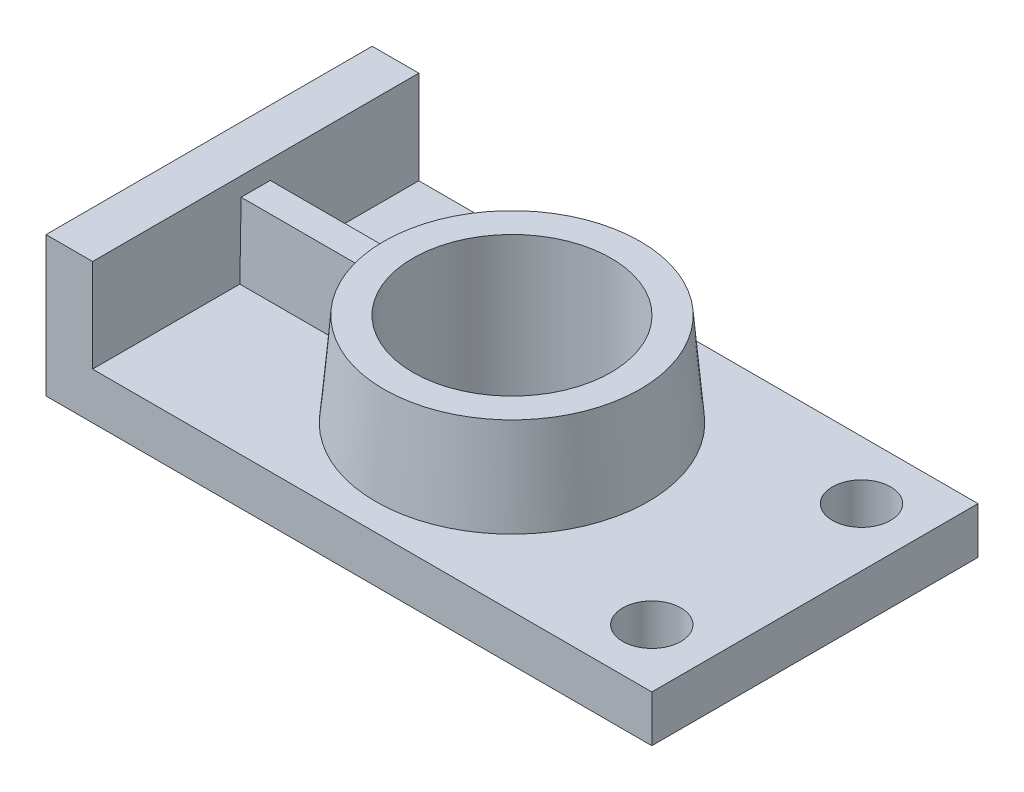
from build123d import *

# Parameters (mm, degrees)
BASE_EXTRUDE_THIN_DEPTH = 88.9
BOSS_EXTRUDE1_REACH     = 193.345
SKETCH2_R               = 34.925
BOSS_EXTRUDE1_DRAFT     = 5
SKETCH3_R               = 26.9875
CUT_EXTRUDE1_DEPTH      = 192.344793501
SKETCH4_R               = 7.9375
CUT_EXTRUDE2_DEPTH      = 190.225738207
RIB1_REACH              = 192.398
SKETCH5_WALLS_W         = 403.925170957
SKETCH5_WALLS_H         = 7.9375
RIB1_DRAFT_ANGLE        = 1


with BuildPart() as part:
    # Sketch1 → Base-Extrude-Thin (new body)
    with BuildSketch(Plane.XY):
        Polygon((0, 38.1), (0, 0), (165.1, 0), (165.1, 12.7), (12.7, 12.7), (12.7, 38.1), align=None)
    extrude(amount=-BASE_EXTRUDE_THIN_DEPTH)




with BuildPart() as boss_extrude1_long_prism_1:
    # Sketch2 → Boss-Extrude1 (the long prism of profile 1, to be tilted and cut off)
    with BuildSketch(Plane(origin=(0, 38.1, 0), x_dir=(-1, 0, 0), z_dir=(0, 1, 0))):
        with Locations((-82.55, -44.45)):
            Circle(SKETCH2_R)
    extrude(amount=-BOSS_EXTRUDE1_REACH)
    boss_extrude1_tool1_sides = [boss_extrude1_long_prism_1.faces().sort_by_distance(p)[0] for p in [
        (117.475, -58.5725, -44.45),
    ]]
    draft(boss_extrude1_tool1_sides, Plane(origin=(0, 38.1, 0), x_dir=(-1, 0, 0), z_dir=(0, 1, 0)), BOSS_EXTRUDE1_DRAFT)  # the draft: side faces tilted about the start plane


with BuildPart() as part_1:
    add(part.part)
    boss_extrude1_tool1 = boss_extrude1_long_prism_1.part - part.part
    add(boss_extrude1_tool1.solids().sort_by_distance((82.55, 38.1, -44.45))[0])

    # Sketch3 → Cut-Extrude1 (cut, through all)
    with BuildSketch(Plane(origin=(0, 38.1, 0), x_dir=(-1, 0, 0), z_dir=(0, 1, 0))):
        with Locations(Location((-82.55, -44.45, 0), (0, 0, 90))):
            Circle(SKETCH3_R)
    extrude(amount=-CUT_EXTRUDE1_DEPTH, mode=Mode.SUBTRACT)

    # Sketch4 → Cut-Extrude2 (cut, through all)
    with BuildSketch(Plane(origin=(0, 12.7, 0), x_dir=(-1, 0, 0), z_dir=(0, 1, 0))):
        with Locations(Location((-149.225, -15.875, 0), (0, 0, 90))):
            Circle(SKETCH4_R)
        with Locations(Location((-149.225, -73.025, 0), (0, 0, 90))):
            Circle(SKETCH4_R)
    extrude(amount=-CUT_EXTRUDE2_DEPTH, mode=Mode.SUBTRACT)

    # Sketch5 walls → Rib1 (add, up to next)
    with BuildSketch(Plane(origin=(0, 33.02, 0), x_dir=(-1, 0, 0), z_dir=(0, 1, 0)), mode=Mode.PRIVATE) as rib1_sk1:
        with Locations((-32.214634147, -44.45)):
            Rectangle(SKETCH5_WALLS_W, SKETCH5_WALLS_H)
    rib1_tool1 = extrude(rib1_sk1.sketch, amount=-RIB1_REACH, mode=Mode.PRIVATE) - part_1.part
    add(rib1_tool1.solids().sort_by_distance((32.214634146, 33.02, -44.45))[0])

    # Rib1 draft
    rib1_draft_faces = [part_1.faces().sort_by_distance(p)[0] for p in [
        (32.214634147, 32.52, -48.41875),
        (32.214634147, 32.52, -40.48125),
    ]]
    draft(rib1_draft_faces, Plane(origin=(32.214634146, 33.02, -44.45), x_dir=(-1, 0, 0), z_dir=(0, 1, 0)), RIB1_DRAFT_ANGLE)


solid = part_1.part
